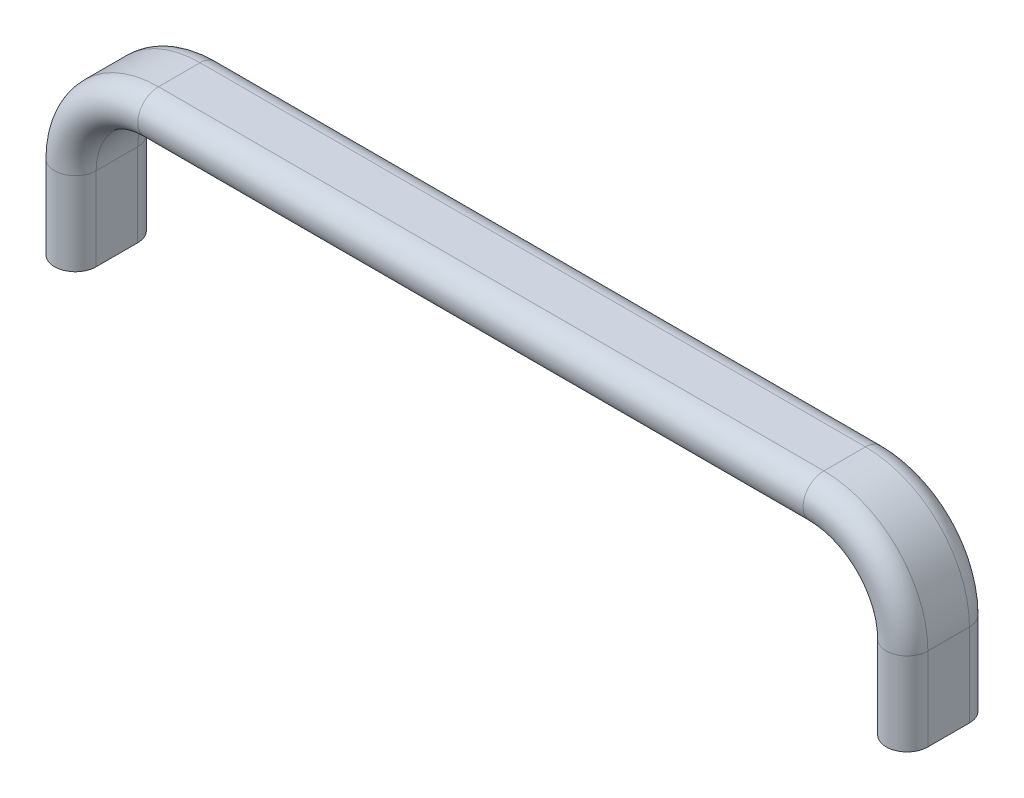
from build123d import *

# Parameters (mm, degrees)
SKETCH3_R      = 2.1
EXTRUDE1_DEPTH = 12.5
SKETCH4_R      = 2.5
EXTRUDE2_DEPTH = 10


with BuildPart() as part:
    # Sweep1: sweep along a path in Sketch1
    with BuildLine(Plane.XY) as sweep1_path:
        Line((-100, 0), (-100, 20))
        ThreePointArc((-100, 20), (-94.142135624, 34.142135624), (-80, 40))
        Line((-80, 40), (80, 40))
        ThreePointArc((80, 40), (94.142135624, 34.142135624), (100, 20))
        Line((100, 20), (100, 0))
    # Sketch2 → Sweep1 (sweep)
    with BuildSketch(Plane(origin=(0, 0, 0), x_dir=(1, 0, 0), z_dir=(0, 1, 0))):
        with BuildLine():
            Line((-105, -5), (-105, 5))
            ThreePointArc((-105, 5), (-100, 10), (-95, 5))
            Line((-95, 5), (-95, -5))
            ThreePointArc((-95, -5), (-100, -10), (-105, -5))
        make_face()
    sweep(path=sweep1_path.line)

    # Sketch3 → Extrude1 (cut)
    with BuildSketch(Plane.XZ):
        with Locations(Location((-100, 0, 0), (0, 0, 270))):
            Circle(SKETCH3_R)
    extrude1 = extrude(amount=-EXTRUDE1_DEPTH, mode=Mode.SUBTRACT)

    # Sketch4 → Extrude2 (cut)
    with BuildSketch(Plane.XZ):
        with Locations(Location((-100, 0, 0), (0, 0, 270))):
            Circle(SKETCH4_R)
    extrude2 = extrude(amount=-EXTRUDE2_DEPTH, mode=Mode.SUBTRACT)

    # Sketch5 → Cut-Revolve1 (revolve, cut)
    with BuildSketch(Plane.XY, mode=Mode.PRIVATE) as cut_revolve1_sk:
        Polygon((-100, 12.5), (-102.1, 12.5), (-100, 13.712435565), align=None)
    cut_revolve1 = revolve(cut_revolve1_sk.sketch.rotate(Axis((-100, 13.712435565, 0), (0, -1, 0)), 90), axis=Axis((-100, 13.712435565, 0), (0, -1, 0)), mode=Mode.SUBTRACT)

    # Mirror1: Extrude1, Extrude2, Cut-Revolve1 across plane
    add(extrude1.mirror(Plane(origin=(0, 0, 0), x_dir=(0, 0, 1), z_dir=(1, 0, 0))), mode=Mode.SUBTRACT)
    add(extrude2.mirror(Plane(origin=(0, 0, 0), x_dir=(0, 0, 1), z_dir=(1, 0, 0))), mode=Mode.SUBTRACT)
    add(cut_revolve1.mirror(Plane(origin=(0, 0, 0), x_dir=(0, 0, 1), z_dir=(1, 0, 0))), mode=Mode.SUBTRACT)


solid = part.part
